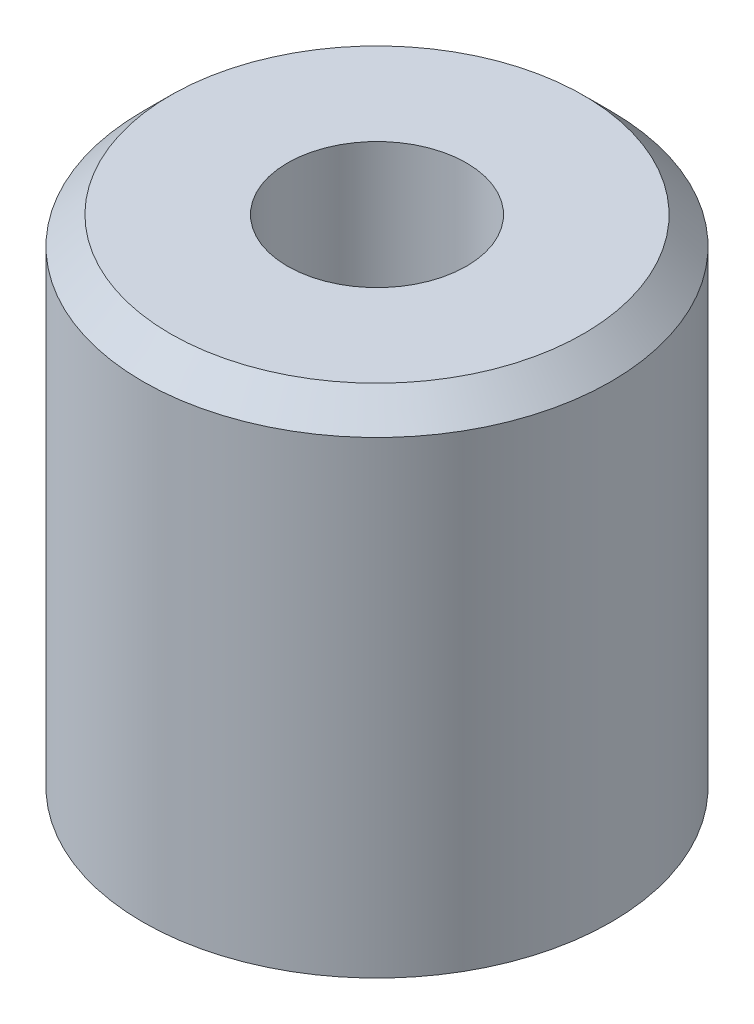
from build123d import *

# Parameters (mm, degrees)
SKICA1_R                 = 8.5
P_IDAT_VYSUNUT_M1_DEPTH  = 18
ZKOSEN_1_SIZE            = 1
SKICA2_R                 = 3.25
ODEBRAT_VYSUNUT_M1_DEPTH = 22.644860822


with BuildPart() as part:
    # Skica1 → P_idat vysunut_m1 (new body)
    with BuildSketch(Plane(origin=(0, 0, 0), x_dir=(1, 0, 0), z_dir=(0, 1, 0))):
        with Locations(Location((0, 0, 0), (0, 0, 270))):
            Circle(SKICA1_R)
    extrude(amount=P_IDAT_VYSUNUT_M1_DEPTH)

    # Zkosen_1
    zkosen_1_edges = [part.edges().sort_by_distance(p)[0] for p in [
        (0, 18, -8.5),
    ]]
    chamfer(zkosen_1_edges, length=ZKOSEN_1_SIZE)

    # Skica2 → Odebrat vysunut_m1 (cut, through all)
    with BuildSketch(Plane(origin=(0, 18, 0), x_dir=(1, 0, 0), z_dir=(0, 1, 0))):
        with Locations(Location((0, 0, 0), (0, 0, 270))):
            Circle(SKICA2_R)
    extrude(amount=-ODEBRAT_VYSUNUT_M1_DEPTH, mode=Mode.SUBTRACT)


solid = part.part
